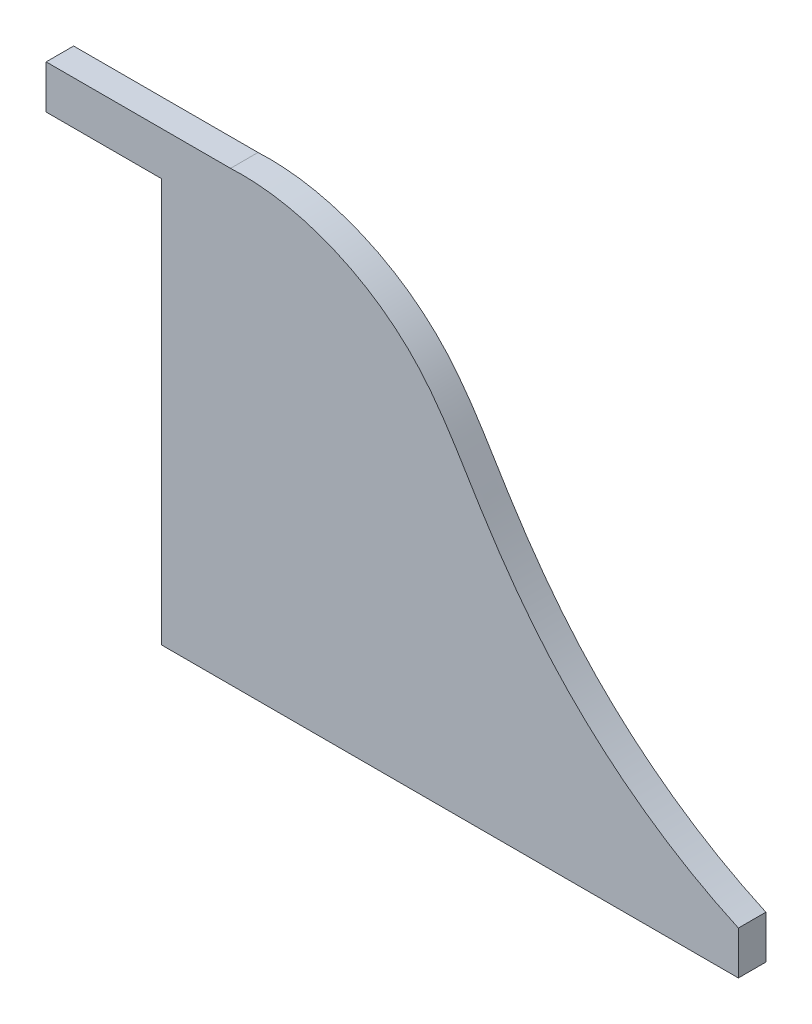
ISO-10303-21;
HEADER;
FILE_DESCRIPTION(('STEP AP214'),'2;1');
FILE_NAME('part.step','',(''),(''),'','','');
FILE_SCHEMA(('AUTOMOTIVE_DESIGN { 1 0 10303 214 1 1 1 1 }'));
ENDSEC;
DATA;
#1=APPLICATION_CONTEXT('core data for automotive mechanical design processes');
#2=APPLICATION_PROTOCOL_DEFINITION('international standard','automotive_design',2000,#1);
#3=PRODUCT_CONTEXT('',#1,'mechanical');
#4=PRODUCT('Part','Part','',(#3));
#5=PRODUCT_RELATED_PRODUCT_CATEGORY('part','',(#4));
#6=PRODUCT_DEFINITION_FORMATION('','',#4);
#7=PRODUCT_DEFINITION_CONTEXT('part definition',#1,'design');
#8=PRODUCT_DEFINITION('design','',#6,#7);
#9=PRODUCT_DEFINITION_SHAPE('','',#8);
#10=(LENGTH_UNIT() NAMED_UNIT(*) SI_UNIT(.MILLI.,.METRE.));
#11=(NAMED_UNIT(*) PLANE_ANGLE_UNIT() SI_UNIT($,.RADIAN.));
#12=(NAMED_UNIT(*) SI_UNIT($,.STERADIAN.) SOLID_ANGLE_UNIT());
#13=UNCERTAINTY_MEASURE_WITH_UNIT(LENGTH_MEASURE(1.E-05),#10,'distance_accuracy_value','');
#14=(GEOMETRIC_REPRESENTATION_CONTEXT(3) GLOBAL_UNCERTAINTY_ASSIGNED_CONTEXT((#13)) GLOBAL_UNIT_ASSIGNED_CONTEXT((#10,
#11,#12)) REPRESENTATION_CONTEXT('',''));
#15=CARTESIAN_POINT('',(0.,0.,0.));
#16=DIRECTION('',(0.,0.,1.));
#17=DIRECTION('',(1.,0.,0.));
#18=AXIS2_PLACEMENT_3D('',#15,#16,#17);
#19=CARTESIAN_POINT('',(-1218.26564916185,213.561036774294,9.525));
#20=DIRECTION('',(0.,1.,0.));
#21=DIRECTION('',(0.,0.,1.));
#22=AXIS2_PLACEMENT_3D('',#19,#20,#21);
#23=PLANE('',#22);
#24=DIRECTION('',(1.,0.,0.));
#25=VECTOR('',#24,1.);
#26=CARTESIAN_POINT('',(-1218.26564916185,213.561036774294,0.));
#27=LINE('',#26,#25);
#28=CARTESIAN_POINT('',(-1218.26564916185,213.561036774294,0.));
#29=VERTEX_POINT('',#28);
#30=CARTESIAN_POINT('',(-1018.26564916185,213.561036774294,0.));
#31=VERTEX_POINT('',#30);
#32=EDGE_CURVE('E120',#29,#31,#27,.T.);
#33=ORIENTED_EDGE('',*,*,#32,.T.);
#34=DIRECTION('',(0.,0.,-1.));
#35=VECTOR('',#34,1.);
#36=CARTESIAN_POINT('',(-1018.26564916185,213.561036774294,9.525));
#37=LINE('',#36,#35);
#38=CARTESIAN_POINT('',(-1018.26564916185,213.561036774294,9.525));
#39=VERTEX_POINT('',#38);
#40=EDGE_CURVE('E11',#39,#31,#37,.T.);
#41=ORIENTED_EDGE('',*,*,#40,.F.);
#42=DIRECTION('',(1.,0.,0.));
#43=VECTOR('',#42,1.);
#44=CARTESIAN_POINT('',(-1218.26564916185,213.561036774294,9.525));
#45=LINE('',#44,#43);
#46=CARTESIAN_POINT('',(-1218.26564916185,213.561036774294,9.525));
#47=VERTEX_POINT('',#46);
#48=EDGE_CURVE('E137',#47,#39,#45,.T.);
#49=ORIENTED_EDGE('',*,*,#48,.F.);
#50=DIRECTION('',(0.,0.,-1.));
#51=VECTOR('',#50,1.);
#52=CARTESIAN_POINT('',(-1218.26564916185,213.561036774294,9.525));
#53=LINE('',#52,#51);
#54=EDGE_CURVE('E116',#47,#29,#53,.T.);
#55=ORIENTED_EDGE('',*,*,#54,.T.);
#56=EDGE_LOOP('',(#33,#41,#49,#55));
#57=FACE_BOUND('',#56,.T.);
#58=ADVANCED_FACE('F30',(#57),#23,.F.);
#59=CARTESIAN_POINT('',(-1018.26564916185,213.561036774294,9.525));
#60=DIRECTION('',(-1.,0.,0.));
#61=DIRECTION('',(0.,0.,1.));
#62=AXIS2_PLACEMENT_3D('',#59,#60,#61);
#63=PLANE('',#62);
#64=DIRECTION('',(0.,1.,0.));
#65=VECTOR('',#64,1.);
#66=CARTESIAN_POINT('',(-1018.26564916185,213.561036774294,0.));
#67=LINE('',#66,#65);
#68=CARTESIAN_POINT('',(-1018.26564916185,228.561036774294,0.));
#69=VERTEX_POINT('',#68);
#70=EDGE_CURVE('E123',#31,#69,#67,.T.);
#71=ORIENTED_EDGE('',*,*,#70,.T.);
#72=DIRECTION('',(0.,0.,-1.));
#73=VECTOR('',#72,1.);
#74=CARTESIAN_POINT('',(-1018.26564916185,228.561036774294,9.525));
#75=LINE('',#74,#73);
#76=CARTESIAN_POINT('',(-1018.26564916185,228.561036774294,9.525));
#77=VERTEX_POINT('',#76);
#78=EDGE_CURVE('E38',#77,#69,#75,.T.);
#79=ORIENTED_EDGE('',*,*,#78,.F.);
#80=DIRECTION('',(0.,1.,0.));
#81=VECTOR('',#80,1.);
#82=CARTESIAN_POINT('',(-1018.26564916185,213.561036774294,9.525));
#83=LINE('',#82,#81);
#84=EDGE_CURVE('E86',#39,#77,#83,.T.);
#85=ORIENTED_EDGE('',*,*,#84,.F.);
#86=ORIENTED_EDGE('',*,*,#40,.T.);
#87=EDGE_LOOP('',(#71,#79,#85,#86));
#88=FACE_BOUND('',#87,.T.);
#89=ADVANCED_FACE('F168',(#88),#63,.F.);
#90=CARTESIAN_POINT('',(-1018.26564916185,228.561036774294,9.525));
#91=CARTESIAN_POINT('',(-1042.46150157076,239.547804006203,9.525));
#92=CARTESIAN_POINT('',(-1076.60124808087,264.676305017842,9.525));
#93=CARTESIAN_POINT('',(-1107.91227959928,308.825021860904,9.525));
#94=CARTESIAN_POINT('',(-1132.92313303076,354.173398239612,9.525));
#95=CARTESIAN_POINT('',(-1170.67872652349,369.838594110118,9.525));
#96=CARTESIAN_POINT('',(-1194.33108423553,368.630949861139,9.525));
#97=B_SPLINE_CURVE_WITH_KNOTS('',3,(#90,#91,#92,#93,#94,#95,#96),.UNSPECIFIED.,.F.,.F.,(4,1,1,1,
4),(0.,0.342591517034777,0.530417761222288,0.69562271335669,1.),.UNSPECIFIED.);
#98=DIRECTION('',(0.,0.,-1.));
#99=VECTOR('',#98,1.);
#100=SURFACE_OF_LINEAR_EXTRUSION('',#97,#99);
#101=CARTESIAN_POINT('',(-1018.26564916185,228.561036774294,0.));
#102=CARTESIAN_POINT('',(-1042.46150157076,239.547804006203,0.));
#103=CARTESIAN_POINT('',(-1076.60124808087,264.676305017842,0.));
#104=CARTESIAN_POINT('',(-1107.91227959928,308.825021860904,0.));
#105=CARTESIAN_POINT('',(-1132.92313303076,354.173398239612,0.));
#106=CARTESIAN_POINT('',(-1170.67872652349,369.838594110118,0.));
#107=CARTESIAN_POINT('',(-1194.33108423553,368.630949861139,0.));
#108=B_SPLINE_CURVE_WITH_KNOTS('',3,(#101,#102,#103,#104,#105,#106,#107),.UNSPECIFIED.,.F.,.F.,
(4,1,1,1,4),(0.,0.342591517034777,0.530417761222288,0.69562271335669,1.),.UNSPECIFIED.);
#109=CARTESIAN_POINT('',(-1194.33108423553,368.630949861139,0.));
#110=VERTEX_POINT('',#109);
#111=EDGE_CURVE('E125',#69,#110,#108,.T.);
#112=ORIENTED_EDGE('',*,*,#111,.T.);
#113=DIRECTION('',(0.,0.,-1.));
#114=VECTOR('',#113,1.);
#115=CARTESIAN_POINT('',(-1194.33108423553,368.630949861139,9.525));
#116=LINE('',#115,#114);
#117=CARTESIAN_POINT('',(-1194.33108423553,368.630949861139,9.525));
#118=VERTEX_POINT('',#117);
#119=EDGE_CURVE('E141',#118,#110,#116,.T.);
#120=ORIENTED_EDGE('',*,*,#119,.F.);
#121=EDGE_CURVE('E149',#77,#118,#97,.T.);
#122=ORIENTED_EDGE('',*,*,#121,.F.);
#123=ORIENTED_EDGE('',*,*,#78,.T.);
#124=EDGE_LOOP('',(#112,#120,#122,#123));
#125=FACE_BOUND('',#124,.T.);
#126=ADVANCED_FACE('F147',(#125),#100,.F.);
#127=CARTESIAN_POINT('',(-1258.26564916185,368.630949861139,9.525));
#128=DIRECTION('',(0.,-1.,0.));
#129=DIRECTION('',(0.,0.,-1.));
#130=AXIS2_PLACEMENT_3D('',#127,#128,#129);
#131=PLANE('',#130);
#132=DIRECTION('',(-1.,0.,0.));
#133=VECTOR('',#132,1.);
#134=CARTESIAN_POINT('',(-1258.26564916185,368.630949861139,0.));
#135=LINE('',#134,#133);
#136=CARTESIAN_POINT('',(-1258.26564916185,368.630949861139,0.));
#137=VERTEX_POINT('',#136);
#138=EDGE_CURVE('E129',#110,#137,#135,.T.);
#139=ORIENTED_EDGE('',*,*,#138,.T.);
#140=DIRECTION('',(0.,0.,-1.));
#141=VECTOR('',#140,1.);
#142=CARTESIAN_POINT('',(-1258.26564916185,368.630949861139,9.525));
#143=LINE('',#142,#141);
#144=CARTESIAN_POINT('',(-1258.26564916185,368.630949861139,9.525));
#145=VERTEX_POINT('',#144);
#146=EDGE_CURVE('E111',#145,#137,#143,.T.);
#147=ORIENTED_EDGE('',*,*,#146,.F.);
#148=DIRECTION('',(-1.,0.,0.));
#149=VECTOR('',#148,1.);
#150=CARTESIAN_POINT('',(-1258.26564916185,368.630949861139,9.525));
#151=LINE('',#150,#149);
#152=EDGE_CURVE('E102',#118,#145,#151,.T.);
#153=ORIENTED_EDGE('',*,*,#152,.F.);
#154=ORIENTED_EDGE('',*,*,#119,.T.);
#155=EDGE_LOOP('',(#139,#147,#153,#154));
#156=FACE_BOUND('',#155,.T.);
#157=ADVANCED_FACE('F155',(#156),#131,.F.);
#158=CARTESIAN_POINT('',(-1258.26564916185,353.561036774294,9.525));
#159=DIRECTION('',(1.,0.,0.));
#160=DIRECTION('',(0.,0.,-1.));
#161=AXIS2_PLACEMENT_3D('',#158,#159,#160);
#162=PLANE('',#161);
#163=DIRECTION('',(0.,-1.,0.));
#164=VECTOR('',#163,1.);
#165=CARTESIAN_POINT('',(-1258.26564916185,353.561036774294,0.));
#166=LINE('',#165,#164);
#167=CARTESIAN_POINT('',(-1258.26564916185,353.561036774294,0.));
#168=VERTEX_POINT('',#167);
#169=EDGE_CURVE('E110',#137,#168,#166,.T.);
#170=ORIENTED_EDGE('',*,*,#169,.T.);
#171=DIRECTION('',(0.,0.,-1.));
#172=VECTOR('',#171,1.);
#173=CARTESIAN_POINT('',(-1258.26564916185,353.561036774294,9.525));
#174=LINE('',#173,#172);
#175=CARTESIAN_POINT('',(-1258.26564916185,353.561036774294,9.525));
#176=VERTEX_POINT('',#175);
#177=EDGE_CURVE('E107',#176,#168,#174,.T.);
#178=ORIENTED_EDGE('',*,*,#177,.F.);
#179=DIRECTION('',(0.,-1.,0.));
#180=VECTOR('',#179,1.);
#181=CARTESIAN_POINT('',(-1258.26564916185,353.561036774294,9.525));
#182=LINE('',#181,#180);
#183=EDGE_CURVE('E96',#145,#176,#182,.T.);
#184=ORIENTED_EDGE('',*,*,#183,.F.);
#185=ORIENTED_EDGE('',*,*,#146,.T.);
#186=EDGE_LOOP('',(#170,#178,#184,#185));
#187=FACE_BOUND('',#186,.T.);
#188=ADVANCED_FACE('F108',(#187),#162,.F.);
#189=CARTESIAN_POINT('',(-1218.26564916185,353.561036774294,9.525));
#190=DIRECTION('',(0.,1.,0.));
#191=DIRECTION('',(0.,0.,1.));
#192=AXIS2_PLACEMENT_3D('',#189,#190,#191);
#193=PLANE('',#192);
#194=DIRECTION('',(1.,0.,0.));
#195=VECTOR('',#194,1.);
#196=CARTESIAN_POINT('',(-1218.26564916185,353.561036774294,0.));
#197=LINE('',#196,#195);
#198=CARTESIAN_POINT('',(-1218.26564916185,353.561036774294,0.));
#199=VERTEX_POINT('',#198);
#200=EDGE_CURVE('E72',#168,#199,#197,.T.);
#201=ORIENTED_EDGE('',*,*,#200,.T.);
#202=DIRECTION('',(0.,0.,-1.));
#203=VECTOR('',#202,1.);
#204=CARTESIAN_POINT('',(-1218.26564916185,353.561036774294,9.525));
#205=LINE('',#204,#203);
#206=CARTESIAN_POINT('',(-1218.26564916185,353.561036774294,9.525));
#207=VERTEX_POINT('',#206);
#208=EDGE_CURVE('E112',#207,#199,#205,.T.);
#209=ORIENTED_EDGE('',*,*,#208,.F.);
#210=DIRECTION('',(1.,0.,0.));
#211=VECTOR('',#210,1.);
#212=CARTESIAN_POINT('',(-1218.26564916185,353.561036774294,9.525));
#213=LINE('',#212,#211);
#214=EDGE_CURVE('E100',#176,#207,#213,.T.);
#215=ORIENTED_EDGE('',*,*,#214,.F.);
#216=ORIENTED_EDGE('',*,*,#177,.T.);
#217=EDGE_LOOP('',(#201,#209,#215,#216));
#218=FACE_BOUND('',#217,.T.);
#219=ADVANCED_FACE('F114',(#218),#193,.F.);
#220=CARTESIAN_POINT('',(-1218.26564916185,213.561036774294,9.525));
#221=DIRECTION('',(1.,0.,0.));
#222=DIRECTION('',(0.,0.,-1.));
#223=AXIS2_PLACEMENT_3D('',#220,#221,#222);
#224=PLANE('',#223);
#225=DIRECTION('',(0.,-1.,0.));
#226=VECTOR('',#225,1.);
#227=CARTESIAN_POINT('',(-1218.26564916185,213.561036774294,0.));
#228=LINE('',#227,#226);
#229=EDGE_CURVE('E78',#199,#29,#228,.T.);
#230=ORIENTED_EDGE('',*,*,#229,.T.);
#231=ORIENTED_EDGE('',*,*,#54,.F.);
#232=DIRECTION('',(0.,-1.,0.));
#233=VECTOR('',#232,1.);
#234=CARTESIAN_POINT('',(-1218.26564916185,213.561036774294,9.525));
#235=LINE('',#234,#233);
#236=EDGE_CURVE('E46',#207,#47,#235,.T.);
#237=ORIENTED_EDGE('',*,*,#236,.F.);
#238=ORIENTED_EDGE('',*,*,#208,.T.);
#239=EDGE_LOOP('',(#230,#231,#237,#238));
#240=FACE_BOUND('',#239,.T.);
#241=ADVANCED_FACE('F177',(#240),#224,.F.);
#242=CARTESIAN_POINT('',(-1104.40779932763,304.798066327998,9.525));
#243=DIRECTION('',(0.,0.,1.));
#244=DIRECTION('',(1.,0.,0.));
#245=AXIS2_PLACEMENT_3D('',#242,#243,#244);
#246=PLANE('',#245);
#247=ORIENTED_EDGE('',*,*,#48,.T.);
#248=ORIENTED_EDGE('',*,*,#84,.T.);
#249=ORIENTED_EDGE('',*,*,#121,.T.);
#250=ORIENTED_EDGE('',*,*,#152,.T.);
#251=ORIENTED_EDGE('',*,*,#183,.T.);
#252=ORIENTED_EDGE('',*,*,#214,.T.);
#253=ORIENTED_EDGE('',*,*,#236,.T.);
#254=EDGE_LOOP('',(#247,#248,#249,#250,#251,#252,#253));
#255=FACE_BOUND('',#254,.T.);
#256=ADVANCED_FACE('F98',(#255),#246,.T.);
#257=CARTESIAN_POINT('',(-1104.40779932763,304.798066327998,0.));
#258=DIRECTION('',(0.,0.,1.));
#259=DIRECTION('',(1.,0.,0.));
#260=AXIS2_PLACEMENT_3D('',#257,#258,#259);
#261=PLANE('',#260);
#262=ORIENTED_EDGE('',*,*,#32,.F.);
#263=ORIENTED_EDGE('',*,*,#229,.F.);
#264=ORIENTED_EDGE('',*,*,#200,.F.);
#265=ORIENTED_EDGE('',*,*,#169,.F.);
#266=ORIENTED_EDGE('',*,*,#138,.F.);
#267=ORIENTED_EDGE('',*,*,#111,.F.);
#268=ORIENTED_EDGE('',*,*,#70,.F.);
#269=EDGE_LOOP('',(#262,#263,#264,#265,#266,#267,#268));
#270=FACE_BOUND('',#269,.T.);
#271=ADVANCED_FACE('F153',(#270),#261,.F.);
#272=CLOSED_SHELL('',(#58,#89,#126,#157,#188,#219,#241,#256,#271));
#273=MANIFOLD_SOLID_BREP('B2',#272);
#274=ADVANCED_BREP_SHAPE_REPRESENTATION('',(#18,#273),#14);
#275=SHAPE_DEFINITION_REPRESENTATION(#9,#274);
ENDSEC;
END-ISO-10303-21;
